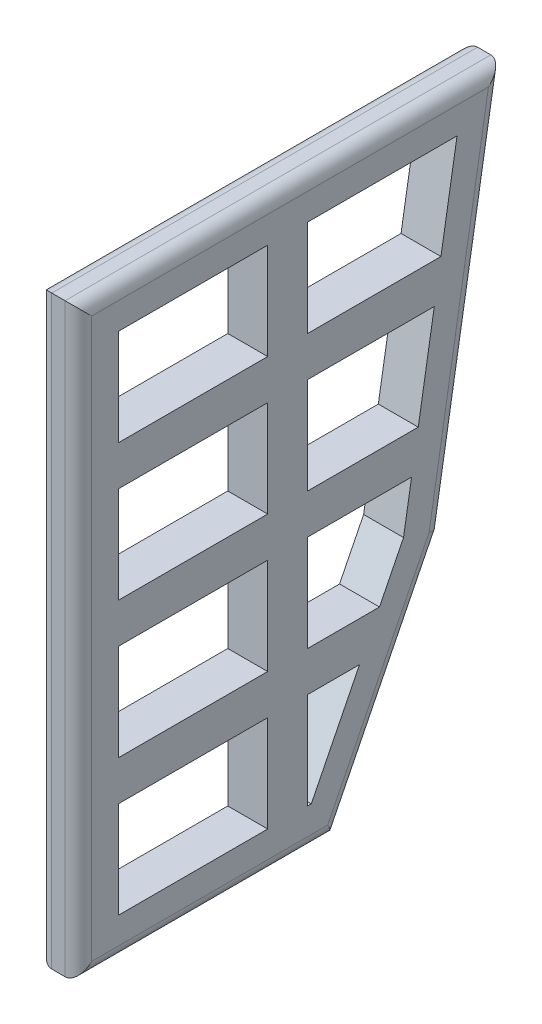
from build123d import *

# Parameters (mm, degrees)
BOSS_EXTRUDE1_DEPTH     = 4.7625
CUT_EXTRUDE1_DEPTH      = 87.500542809
CUT_EXTRUDE1_DEPTH_BACK = 87.500542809
FILLET1_R               = 1.5875
SKETCH3_W               = 4.7625
SKETCH3_H               = 4.7625
BOSS_EXTRUDE2_DEPTH     = 60.325
BOSS_EXTRUDE3_REACH     = 85.792
SKETCH4_W               = 4.7625
SKETCH4_H               = 4.7625
BOSS_EXTRUDE4_REACH     = 85.792
SKETCH5_W               = 4.7625
SKETCH5_H               = 4.7625
BOSS_EXTRUDE5_REACH     = 85.792
SKETCH6_W               = 4.7625
SKETCH6_H               = 4.7625


with BuildPart() as part:
    # Sketch1 → Boss-Extrude1 (new body)
    with BuildSketch(Plane(origin=(0, 0, 0), x_dir=(0, 0, -1), z_dir=(1, 0, 0))):
        Polygon((0, 0), (0, 69.85), (50.8, 69.85), (43.374677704, 25.286928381), (30.734, 0), align=None)
    extrude(amount=BOSS_EXTRUDE1_DEPTH)

    # Sketch2 → Cut-Extrude1 (cut, two sides: drawn at the far end of the back side and taken through both)
    with BuildSketch(Plane(origin=(4.7625, 0, 0), x_dir=(0, 0, -1), z_dir=(1, 0, 0)).offset(-CUT_EXTRUDE1_DEPTH_BACK)):
        Polygon((4.7625, 65.0875), (4.7625, 4.7625), (27.790323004, 4.7625), (38.794627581, 26.775960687), (45.178288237, 65.0875), align=None)
    extrude(amount=CUT_EXTRUDE1_DEPTH + CUT_EXTRUDE1_DEPTH_BACK, mode=Mode.SUBTRACT)

    # Fillet1
    fillet1_edges = [part.edges().sort_by_distance(p)[0] for p in [
        (4.7625, 47.568464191, -47.087338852),
        (4.7625, 69.85, -25.4),
        (4.7625, 34.925, 0),
        (4.7625, 0, -15.367),
        (0, 34.925, 0),
        (0, 69.85, -25.4),
        (0, 47.568464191, -47.087338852),
        (0, 12.643464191, -37.054338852),
        (0, 0, -15.367),
        (4.7625, 12.643464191, -37.054338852),
    ]]
    fillet(fillet1_edges, radius=FILLET1_R)

    # Sketch3 → Boss-Extrude2 (add)
    with BuildSketch(Plane.XZ.offset(-65.0875)):
        with Locations((2.38125, -24.970394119)):
            Rectangle(SKETCH3_W, SKETCH3_H)
    extrude(amount=BOSS_EXTRUDE2_DEPTH)

    # Boss-Extrude3: up to this plane
    boss_extrude3_end = Plane(origin=(0, 26.775960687, -38.794627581), z_dir=(0, -0.16435900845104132, -0.9864005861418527))
    # Sketch4 → Boss-Extrude3 (add, up to the surface)
    with BuildSketch(Plane(origin=(0, 0, -4.7625), x_dir=(-1, 0, 0), z_dir=(0, 0, -1)), mode=Mode.PRIVATE) as boss_extrude3_sk1:
        with Locations((-2.38125, 34.925)):
            Rectangle(SKETCH4_W, SKETCH4_H)
    boss_extrude3_tool1 = split(extrude(boss_extrude3_sk1.sketch, amount=BOSS_EXTRUDE3_REACH, mode=Mode.PRIVATE), bisect_by=boss_extrude3_end, keep=Keep.BOTH, mode=Mode.PRIVATE)
    add(boss_extrude3_tool1.solids().sort_by_distance((2.38125, 34.925, -4.7625))[0])

    # Boss-Extrude4: up to this plane
    boss_extrude4_end = Plane(origin=(0, 26.775960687, -38.794627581), z_dir=(0, -0.16435900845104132, -0.9864005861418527))
    # Sketch5 → Boss-Extrude4 (add, up to the surface)
    with BuildSketch(Plane(origin=(0, 0, -4.7625), x_dir=(-1, 0, 0), z_dir=(0, 0, -1)), mode=Mode.PRIVATE) as boss_extrude4_sk1:
        with Locations((-2.38125, 51.196875)):
            Rectangle(SKETCH5_W, SKETCH5_H)
    boss_extrude4_tool1 = split(extrude(boss_extrude4_sk1.sketch, amount=BOSS_EXTRUDE4_REACH, mode=Mode.PRIVATE), bisect_by=boss_extrude4_end, keep=Keep.BOTH, mode=Mode.PRIVATE)
    add(boss_extrude4_tool1.solids().sort_by_distance((2.38125, 51.196875, -4.7625))[0])

    # Boss-Extrude5: up to this plane
    boss_extrude5_end = Plane(origin=(0, 4.7625, -27.790323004), z_dir=(0, -0.4471347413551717, -0.8944666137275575))
    # Sketch6 → Boss-Extrude5 (add, up to the surface)
    with BuildSketch(Plane(origin=(0, 0, -4.7625), x_dir=(-1, 0, 0), z_dir=(0, 0, -1)), mode=Mode.PRIVATE) as boss_extrude5_sk1:
        with Locations((-2.38125, 18.653125)):
            Rectangle(SKETCH6_W, SKETCH6_H)
    boss_extrude5_tool1 = split(extrude(boss_extrude5_sk1.sketch, amount=BOSS_EXTRUDE5_REACH, mode=Mode.PRIVATE), bisect_by=boss_extrude5_end, keep=Keep.BOTH, mode=Mode.PRIVATE)
    add(boss_extrude5_tool1.solids().sort_by_distance((2.38125, 18.653125, -4.7625))[0])


solid = part.part
